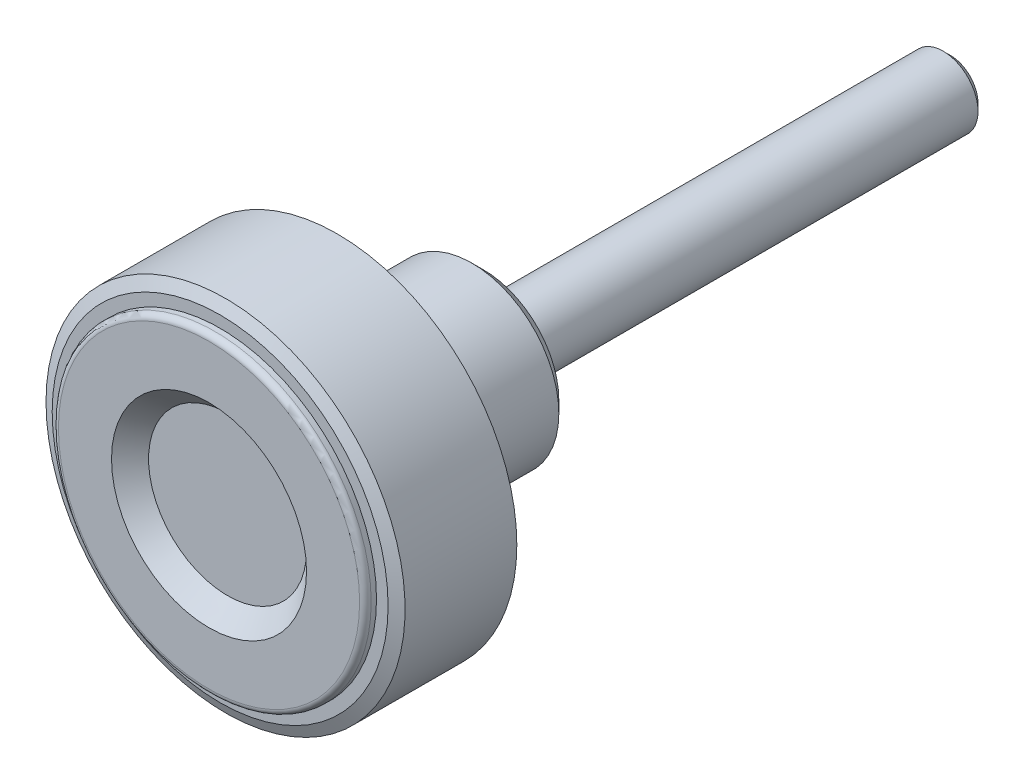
ISO-10303-21;
HEADER;
FILE_DESCRIPTION(('STEP AP214'),'2;1');
FILE_NAME('part.step','',(''),(''),'','','');
FILE_SCHEMA(('AUTOMOTIVE_DESIGN { 1 0 10303 214 1 1 1 1 }'));
ENDSEC;
DATA;
#1=APPLICATION_CONTEXT('core data for automotive mechanical design processes');
#2=APPLICATION_PROTOCOL_DEFINITION('international standard','automotive_design',2000,#1);
#3=PRODUCT_CONTEXT('',#1,'mechanical');
#4=PRODUCT('Part','Part','',(#3));
#5=PRODUCT_RELATED_PRODUCT_CATEGORY('part','',(#4));
#6=PRODUCT_DEFINITION_FORMATION('','',#4);
#7=PRODUCT_DEFINITION_CONTEXT('part definition',#1,'design');
#8=PRODUCT_DEFINITION('design','',#6,#7);
#9=PRODUCT_DEFINITION_SHAPE('','',#8);
#10=(LENGTH_UNIT() NAMED_UNIT(*) SI_UNIT(.MILLI.,.METRE.));
#11=(NAMED_UNIT(*) PLANE_ANGLE_UNIT() SI_UNIT($,.RADIAN.));
#12=(NAMED_UNIT(*) SI_UNIT($,.STERADIAN.) SOLID_ANGLE_UNIT());
#13=UNCERTAINTY_MEASURE_WITH_UNIT(LENGTH_MEASURE(1.E-05),#10,'distance_accuracy_value','');
#14=(GEOMETRIC_REPRESENTATION_CONTEXT(3) GLOBAL_UNCERTAINTY_ASSIGNED_CONTEXT((#13)) GLOBAL_UNIT_ASSIGNED_CONTEXT((#10,
#11,#12)) REPRESENTATION_CONTEXT('',''));
#15=CARTESIAN_POINT('',(0.,0.,0.));
#16=DIRECTION('',(0.,0.,1.));
#17=DIRECTION('',(1.,0.,0.));
#18=AXIS2_PLACEMENT_3D('',#15,#16,#17);
#19=CARTESIAN_POINT('',(0.,0.,0.));
#20=DIRECTION('',(0.,0.,-1.));
#21=DIRECTION('',(-1.,0.,0.));
#22=AXIS2_PLACEMENT_3D('',#19,#20,#21);
#23=CYLINDRICAL_SURFACE('',#22,15.5);
#24=CARTESIAN_POINT('',(0.,0.,22.573692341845));
#25=DIRECTION('',(0.,0.,-1.));
#26=DIRECTION('',(-1.,0.,0.));
#27=AXIS2_PLACEMENT_3D('',#24,#25,#26);
#28=CIRCLE('',#27,15.5);
#29=CARTESIAN_POINT('',(-15.5,0.,22.573692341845));
#30=VERTEX_POINT('',#29);
#31=EDGE_CURVE('E164',#30,#30,#28,.T.);
#32=ORIENTED_EDGE('',*,*,#31,.T.);
#33=EDGE_LOOP('',(#32));
#34=FACE_BOUND('',#33,.T.);
#35=CARTESIAN_POINT('',(0.,0.,12.926307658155));
#36=DIRECTION('',(0.,0.,1.));
#37=DIRECTION('',(0.,1.,0.));
#38=AXIS2_PLACEMENT_3D('',#35,#36,#37);
#39=CIRCLE('',#38,15.5);
#40=CARTESIAN_POINT('',(0.,15.5,12.926307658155));
#41=VERTEX_POINT('',#40);
#42=EDGE_CURVE('E160',#41,#41,#39,.F.);
#43=ORIENTED_EDGE('',*,*,#42,.F.);
#44=EDGE_LOOP('',(#43));
#45=FACE_BOUND('',#44,.T.);
#46=ADVANCED_FACE('F14',(#34,#45),#23,.T.);
#47=CARTESIAN_POINT('',(0.,0.,12.926307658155));
#48=DIRECTION('',(0.,0.,1.));
#49=DIRECTION('',(1.,0.,0.));
#50=AXIS2_PLACEMENT_3D('',#47,#48,#49);
#51=CONICAL_SURFACE('',#50,15.5,1.13446401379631);
#52=CARTESIAN_POINT('',(0.,0.,12.46));
#53=DIRECTION('',(0.,0.,1.));
#54=DIRECTION('',(1.,0.,0.));
#55=AXIS2_PLACEMENT_3D('',#52,#53,#54);
#56=CIRCLE('',#55,14.5);
#57=CARTESIAN_POINT('',(14.5,0.,12.46));
#58=VERTEX_POINT('',#57);
#59=EDGE_CURVE('E157',#58,#58,#56,.F.);
#60=ORIENTED_EDGE('',*,*,#59,.F.);
#61=EDGE_LOOP('',(#60));
#62=FACE_BOUND('',#61,.T.);
#63=ORIENTED_EDGE('',*,*,#42,.T.);
#64=EDGE_LOOP('',(#63));
#65=FACE_BOUND('',#64,.T.);
#66=ADVANCED_FACE('F457',(#62,#65),#51,.T.);
#67=CARTESIAN_POINT('',(0.,14.,12.46));
#68=DIRECTION('',(0.,0.,-1.));
#69=DIRECTION('',(-1.,0.,0.));
#70=AXIS2_PLACEMENT_3D('',#67,#68,#69);
#71=PLANE('',#70);
#72=ORIENTED_EDGE('',*,*,#59,.T.);
#73=EDGE_LOOP('',(#72));
#74=FACE_BOUND('',#73,.T.);
#75=CARTESIAN_POINT('',(0.,0.,12.46));
#76=DIRECTION('',(0.,0.,1.));
#77=DIRECTION('',(1.,0.,0.));
#78=AXIS2_PLACEMENT_3D('',#75,#76,#77);
#79=CIRCLE('',#78,13.5);
#80=CARTESIAN_POINT('',(13.5,0.,12.46));
#81=VERTEX_POINT('',#80);
#82=EDGE_CURVE('E154',#81,#81,#79,.F.);
#83=ORIENTED_EDGE('',*,*,#82,.F.);
#84=EDGE_LOOP('',(#83));
#85=FACE_BOUND('',#84,.T.);
#86=ADVANCED_FACE('F453',(#74,#85),#71,.T.);
#87=CARTESIAN_POINT('',(0.,1.19325,-40.));
#88=DIRECTION('',(0.,0.,-1.));
#89=DIRECTION('',(-1.,0.,0.));
#90=AXIS2_PLACEMENT_3D('',#87,#88,#89);
#91=PLANE('',#90);
#92=CARTESIAN_POINT('',(0.,0.,-39.9999999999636));
#93=DIRECTION('',(0.,0.,1.));
#94=DIRECTION('',(1.,0.,0.));
#95=AXIS2_PLACEMENT_3D('',#92,#93,#94);
#96=CIRCLE('',#95,2.38650000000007);
#97=CARTESIAN_POINT('',(2.38650000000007,0.,-39.9999999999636));
#98=VERTEX_POINT('',#97);
#99=EDGE_CURVE('E150',#98,#98,#96,.T.);
#100=ORIENTED_EDGE('',*,*,#99,.F.);
#101=EDGE_LOOP('',(#100));
#102=FACE_BOUND('',#101,.T.);
#103=ADVANCED_FACE('F449',(#102),#91,.T.);
#104=CARTESIAN_POINT('',(0.,0.,12.23));
#105=DIRECTION('',(0.,0.,1.));
#106=DIRECTION('',(1.,0.,0.));
#107=AXIS2_PLACEMENT_3D('',#104,#105,#106);
#108=CYLINDRICAL_SURFACE('',#107,13.5);
#109=ORIENTED_EDGE('',*,*,#82,.T.);
#110=EDGE_LOOP('',(#109));
#111=FACE_BOUND('',#110,.T.);
#112=CARTESIAN_POINT('',(0.,0.,12.));
#113=DIRECTION('',(0.,0.,-1.));
#114=DIRECTION('',(-1.,0.,0.));
#115=AXIS2_PLACEMENT_3D('',#112,#113,#114);
#116=CIRCLE('',#115,13.5);
#117=CARTESIAN_POINT('',(-13.5,0.,12.));
#118=VERTEX_POINT('',#117);
#119=EDGE_CURVE('E153',#118,#118,#116,.T.);
#120=ORIENTED_EDGE('',*,*,#119,.F.);
#121=EDGE_LOOP('',(#120));
#122=FACE_BOUND('',#121,.T.);
#123=ADVANCED_FACE('F416',(#111,#122),#108,.T.);
#124=CARTESIAN_POINT('',(0.,0.,-39.3865000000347));
#125=DIRECTION('',(0.,0.,1.));
#126=DIRECTION('',(1.,0.,0.));
#127=AXIS2_PLACEMENT_3D('',#124,#125,#126);
#128=CONICAL_SURFACE('',#127,2.99999999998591,0.785398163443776);
#129=ORIENTED_EDGE('',*,*,#99,.T.);
#130=EDGE_LOOP('',(#129));
#131=FACE_BOUND('',#130,.T.);
#132=CARTESIAN_POINT('',(0.,0.,-39.3865));
#133=DIRECTION('',(0.,0.,1.));
#134=DIRECTION('',(1.,0.,0.));
#135=AXIS2_PLACEMENT_3D('',#132,#133,#134);
#136=CIRCLE('',#135,3.);
#137=CARTESIAN_POINT('',(3.,0.,-39.3865));
#138=VERTEX_POINT('',#137);
#139=EDGE_CURVE('E343',#138,#138,#136,.T.);
#140=ORIENTED_EDGE('',*,*,#139,.F.);
#141=EDGE_LOOP('',(#140));
#142=FACE_BOUND('',#141,.T.);
#143=ADVANCED_FACE('F410',(#131,#142),#128,.T.);
#144=CARTESIAN_POINT('',(0.,0.,12.));
#145=DIRECTION('',(0.,0.,-1.));
#146=DIRECTION('',(-1.,0.,0.));
#147=AXIS2_PLACEMENT_3D('',#144,#145,#146);
#148=TOROIDAL_SURFACE('',#147,13.,0.5);
#149=ORIENTED_EDGE('',*,*,#119,.T.);
#150=EDGE_LOOP('',(#149));
#151=FACE_BOUND('',#150,.T.);
#152=CARTESIAN_POINT('',(0.,0.,11.5));
#153=DIRECTION('',(0.,0.,1.));
#154=DIRECTION('',(1.,0.,0.));
#155=AXIS2_PLACEMENT_3D('',#152,#153,#154);
#156=CIRCLE('',#155,13.);
#157=CARTESIAN_POINT('',(0.,13.,11.5));
#158=VERTEX_POINT('',#157);
#159=CARTESIAN_POINT('',(13.,0.,11.5));
#160=VERTEX_POINT('',#159);
#161=EDGE_CURVE('E306',#158,#160,#156,.F.);
#162=ORIENTED_EDGE('',*,*,#161,.F.);
#163=CARTESIAN_POINT('',(0.,0.,11.5));
#164=DIRECTION('',(0.,0.,1.));
#165=DIRECTION('',(0.,1.,0.));
#166=AXIS2_PLACEMENT_3D('',#163,#164,#165);
#167=CIRCLE('',#166,13.);
#168=CARTESIAN_POINT('',(-13.,0.,11.5));
#169=VERTEX_POINT('',#168);
#170=EDGE_CURVE('E149',#169,#158,#167,.F.);
#171=ORIENTED_EDGE('',*,*,#170,.F.);
#172=CARTESIAN_POINT('',(0.,0.,11.5));
#173=DIRECTION('',(0.,0.,1.));
#174=DIRECTION('',(-1.,0.,0.));
#175=AXIS2_PLACEMENT_3D('',#172,#173,#174);
#176=CIRCLE('',#175,13.);
#177=EDGE_CURVE('E340',#160,#169,#176,.F.);
#178=ORIENTED_EDGE('',*,*,#177,.F.);
#179=EDGE_LOOP('',(#162,#171,#178));
#180=FACE_BOUND('',#179,.T.);
#181=ADVANCED_FACE('F405',(#151,#180),#148,.T.);
#182=CARTESIAN_POINT('',(0.,0.,-19.19325));
#183=DIRECTION('',(0.,0.,1.));
#184=DIRECTION('',(1.,0.,0.));
#185=AXIS2_PLACEMENT_3D('',#182,#183,#184);
#186=CYLINDRICAL_SURFACE('',#185,3.);
#187=ORIENTED_EDGE('',*,*,#139,.T.);
#188=EDGE_LOOP('',(#187));
#189=FACE_BOUND('',#188,.T.);
#190=CARTESIAN_POINT('',(0.,0.,0.));
#191=DIRECTION('',(0.,0.,1.));
#192=DIRECTION('',(1.,0.,0.));
#193=AXIS2_PLACEMENT_3D('',#190,#191,#192);
#194=CIRCLE('',#193,3.);
#195=CARTESIAN_POINT('',(3.,0.,0.));
#196=VERTEX_POINT('',#195);
#197=EDGE_CURVE('E146',#196,#196,#194,.T.);
#198=ORIENTED_EDGE('',*,*,#197,.F.);
#199=EDGE_LOOP('',(#198));
#200=FACE_BOUND('',#199,.T.);
#201=ADVANCED_FACE('F323',(#189,#200),#186,.T.);
#202=CARTESIAN_POINT('',(0.,12.4615384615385,11.5));
#203=DIRECTION('',(0.,0.,-1.));
#204=DIRECTION('',(-1.,0.,0.));
#205=AXIS2_PLACEMENT_3D('',#202,#203,#204);
#206=PLANE('',#205);
#207=ORIENTED_EDGE('',*,*,#177,.T.);
#208=ORIENTED_EDGE('',*,*,#170,.T.);
#209=ORIENTED_EDGE('',*,*,#161,.T.);
#210=EDGE_LOOP('',(#207,#208,#209));
#211=FACE_BOUND('',#210,.T.);
#212=CARTESIAN_POINT('',(0.,0.,11.5));
#213=DIRECTION('',(0.,0.,1.));
#214=DIRECTION('',(1.,0.,0.));
#215=AXIS2_PLACEMENT_3D('',#212,#213,#214);
#216=CIRCLE('',#215,11.9230769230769);
#217=CARTESIAN_POINT('',(11.9230769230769,0.,11.5));
#218=VERTEX_POINT('',#217);
#219=EDGE_CURVE('E143',#218,#218,#216,.T.);
#220=ORIENTED_EDGE('',*,*,#219,.T.);
#221=EDGE_LOOP('',(#220));
#222=FACE_BOUND('',#221,.T.);
#223=ADVANCED_FACE('F312',(#211,#222),#206,.T.);
#224=CARTESIAN_POINT('',(0.,2.,0.));
#225=DIRECTION('',(0.,0.,-1.));
#226=DIRECTION('',(-1.,0.,0.));
#227=AXIS2_PLACEMENT_3D('',#224,#225,#226);
#228=PLANE('',#227);
#229=CARTESIAN_POINT('',(0.,0.,0.));
#230=DIRECTION('',(0.,0.,1.));
#231=DIRECTION('',(1.,0.,0.));
#232=AXIS2_PLACEMENT_3D('',#229,#230,#231);
#233=CIRCLE('',#232,4.);
#234=CARTESIAN_POINT('',(4.,0.,0.));
#235=VERTEX_POINT('',#234);
#236=EDGE_CURVE('E140',#235,#235,#233,.T.);
#237=ORIENTED_EDGE('',*,*,#236,.F.);
#238=EDGE_LOOP('',(#237));
#239=FACE_BOUND('',#238,.T.);
#240=ORIENTED_EDGE('',*,*,#197,.T.);
#241=EDGE_LOOP('',(#240));
#242=FACE_BOUND('',#241,.T.);
#243=ADVANCED_FACE('F322',(#239,#242),#228,.T.);
#244=CARTESIAN_POINT('',(0.,0.,15.25));
#245=DIRECTION('',(0.,0.,1.));
#246=DIRECTION('',(1.,0.,0.));
#247=AXIS2_PLACEMENT_3D('',#244,#245,#246);
#248=CYLINDRICAL_SURFACE('',#247,11.9230769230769);
#249=CARTESIAN_POINT('',(0.,0.,19.));
#250=DIRECTION('',(0.,0.,-1.));
#251=DIRECTION('',(-1.,0.,0.));
#252=AXIS2_PLACEMENT_3D('',#249,#250,#251);
#253=CIRCLE('',#252,11.9230769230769);
#254=CARTESIAN_POINT('',(-11.9230769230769,0.,19.));
#255=VERTEX_POINT('',#254);
#256=EDGE_CURVE('E139',#255,#255,#253,.F.);
#257=ORIENTED_EDGE('',*,*,#256,.T.);
#258=EDGE_LOOP('',(#257));
#259=FACE_BOUND('',#258,.T.);
#260=ORIENTED_EDGE('',*,*,#219,.F.);
#261=EDGE_LOOP('',(#260));
#262=FACE_BOUND('',#261,.T.);
#263=ADVANCED_FACE('F391',(#259,#262),#248,.F.);
#264=CARTESIAN_POINT('',(0.,0.,0.15));
#265=DIRECTION('',(0.,0.,1.));
#266=DIRECTION('',(1.,0.,0.));
#267=AXIS2_PLACEMENT_3D('',#264,#265,#266);
#268=CYLINDRICAL_SURFACE('',#267,4.);
#269=ORIENTED_EDGE('',*,*,#236,.T.);
#270=EDGE_LOOP('',(#269));
#271=FACE_BOUND('',#270,.T.);
#272=CARTESIAN_POINT('',(0.,0.,0.3));
#273=DIRECTION('',(0.,0.,1.));
#274=DIRECTION('',(1.,0.,0.));
#275=AXIS2_PLACEMENT_3D('',#272,#273,#274);
#276=CIRCLE('',#275,4.);
#277=CARTESIAN_POINT('',(4.,0.,0.3));
#278=VERTEX_POINT('',#277);
#279=EDGE_CURVE('E135',#278,#278,#276,.T.);
#280=ORIENTED_EDGE('',*,*,#279,.F.);
#281=EDGE_LOOP('',(#280));
#282=FACE_BOUND('',#281,.T.);
#283=ADVANCED_FACE('F282',(#271,#282),#268,.T.);
#284=CARTESIAN_POINT('',(0.,0.,19.));
#285=DIRECTION('',(0.,0.,-1.));
#286=DIRECTION('',(-1.,0.,0.));
#287=AXIS2_PLACEMENT_3D('',#284,#285,#286);
#288=TOROIDAL_SURFACE('',#287,10.9230769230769,1.);
#289=CARTESIAN_POINT('',(0.,0.,20.));
#290=DIRECTION('',(0.,0.,1.));
#291=DIRECTION('',(0.,1.,0.));
#292=AXIS2_PLACEMENT_3D('',#289,#290,#291);
#293=CIRCLE('',#292,10.9230769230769);
#294=CARTESIAN_POINT('',(-10.9230769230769,0.,20.));
#295=VERTEX_POINT('',#294);
#296=CARTESIAN_POINT('',(0.,10.9230769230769,20.));
#297=VERTEX_POINT('',#296);
#298=EDGE_CURVE('E134',#295,#297,#293,.F.);
#299=ORIENTED_EDGE('',*,*,#298,.F.);
#300=CARTESIAN_POINT('',(0.,0.,20.));
#301=DIRECTION('',(0.,0.,1.));
#302=DIRECTION('',(-1.,0.,0.));
#303=AXIS2_PLACEMENT_3D('',#300,#301,#302);
#304=CIRCLE('',#303,10.9230769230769);
#305=CARTESIAN_POINT('',(10.9230769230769,0.,20.));
#306=VERTEX_POINT('',#305);
#307=EDGE_CURVE('E656',#306,#295,#304,.F.);
#308=ORIENTED_EDGE('',*,*,#307,.F.);
#309=CARTESIAN_POINT('',(0.,0.,20.));
#310=DIRECTION('',(0.,0.,1.));
#311=DIRECTION('',(1.,0.,0.));
#312=AXIS2_PLACEMENT_3D('',#309,#310,#311);
#313=CIRCLE('',#312,10.9230769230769);
#314=EDGE_CURVE('E138',#297,#306,#313,.F.);
#315=ORIENTED_EDGE('',*,*,#314,.F.);
#316=EDGE_LOOP('',(#299,#308,#315));
#317=FACE_BOUND('',#316,.T.);
#318=ORIENTED_EDGE('',*,*,#256,.F.);
#319=EDGE_LOOP('',(#318));
#320=FACE_BOUND('',#319,.T.);
#321=ADVANCED_FACE('F278',(#317,#320),#288,.F.);
#322=CARTESIAN_POINT('',(0.,5.25,0.3));
#323=DIRECTION('',(0.,0.,-1.));
#324=DIRECTION('',(-1.,0.,0.));
#325=AXIS2_PLACEMENT_3D('',#322,#323,#324);
#326=PLANE('',#325);
#327=CARTESIAN_POINT('',(0.,0.,0.3));
#328=DIRECTION('',(0.,0.,1.));
#329=DIRECTION('',(1.,0.,0.));
#330=AXIS2_PLACEMENT_3D('',#327,#328,#329);
#331=CIRCLE('',#330,6.5);
#332=CARTESIAN_POINT('',(6.5,0.,0.3));
#333=VERTEX_POINT('',#332);
#334=EDGE_CURVE('E125',#333,#333,#331,.T.);
#335=ORIENTED_EDGE('',*,*,#334,.F.);
#336=EDGE_LOOP('',(#335));
#337=FACE_BOUND('',#336,.T.);
#338=ORIENTED_EDGE('',*,*,#279,.T.);
#339=EDGE_LOOP('',(#338));
#340=FACE_BOUND('',#339,.T.);
#341=ADVANCED_FACE('F216',(#337,#340),#326,.T.);
#342=CARTESIAN_POINT('',(0.,9.71153846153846,20.));
#343=DIRECTION('',(0.,0.,-1.));
#344=DIRECTION('',(-1.,0.,0.));
#345=AXIS2_PLACEMENT_3D('',#342,#343,#344);
#346=PLANE('',#345);
#347=ORIENTED_EDGE('',*,*,#307,.T.);
#348=ORIENTED_EDGE('',*,*,#298,.T.);
#349=ORIENTED_EDGE('',*,*,#314,.T.);
#350=EDGE_LOOP('',(#347,#348,#349));
#351=FACE_BOUND('',#350,.T.);
#352=CARTESIAN_POINT('',(0.,0.,20.));
#353=DIRECTION('',(0.,0.,-1.));
#354=DIRECTION('',(-1.,0.,0.));
#355=AXIS2_PLACEMENT_3D('',#352,#353,#354);
#356=CIRCLE('',#355,8.5);
#357=CARTESIAN_POINT('',(0.,8.5,20.));
#358=VERTEX_POINT('',#357);
#359=CARTESIAN_POINT('',(-8.5,0.,20.));
#360=VERTEX_POINT('',#359);
#361=EDGE_CURVE('E33',#358,#360,#356,.F.);
#362=ORIENTED_EDGE('',*,*,#361,.T.);
#363=CARTESIAN_POINT('',(0.,0.,20.));
#364=DIRECTION('',(0.,0.,-1.));
#365=DIRECTION('',(1.,0.,0.));
#366=AXIS2_PLACEMENT_3D('',#363,#364,#365);
#367=CIRCLE('',#366,8.5);
#368=CARTESIAN_POINT('',(8.5,0.,20.));
#369=VERTEX_POINT('',#368);
#370=EDGE_CURVE('E133',#360,#369,#367,.F.);
#371=ORIENTED_EDGE('',*,*,#370,.T.);
#372=CARTESIAN_POINT('',(0.,0.,20.));
#373=DIRECTION('',(0.,0.,-1.));
#374=DIRECTION('',(0.,1.,0.));
#375=AXIS2_PLACEMENT_3D('',#372,#373,#374);
#376=CIRCLE('',#375,8.5);
#377=EDGE_CURVE('E203',#369,#358,#376,.F.);
#378=ORIENTED_EDGE('',*,*,#377,.T.);
#379=EDGE_LOOP('',(#362,#371,#378));
#380=FACE_BOUND('',#379,.T.);
#381=ADVANCED_FACE('F207',(#351,#380),#346,.T.);
#382=CARTESIAN_POINT('',(0.,0.,1.3));
#383=DIRECTION('',(0.,0.,1.));
#384=DIRECTION('',(1.,0.,0.));
#385=AXIS2_PLACEMENT_3D('',#382,#383,#384);
#386=CONICAL_SURFACE('',#385,7.5,0.785398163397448);
#387=ORIENTED_EDGE('',*,*,#334,.T.);
#388=EDGE_LOOP('',(#387));
#389=FACE_BOUND('',#388,.T.);
#390=CARTESIAN_POINT('',(0.,0.,1.3));
#391=DIRECTION('',(0.,0.,1.));
#392=DIRECTION('',(1.,0.,0.));
#393=AXIS2_PLACEMENT_3D('',#390,#391,#392);
#394=CIRCLE('',#393,7.5);
#395=CARTESIAN_POINT('',(7.5,0.,1.3));
#396=VERTEX_POINT('',#395);
#397=EDGE_CURVE('E24',#396,#396,#394,.T.);
#398=ORIENTED_EDGE('',*,*,#397,.F.);
#399=EDGE_LOOP('',(#398));
#400=FACE_BOUND('',#399,.T.);
#401=ADVANCED_FACE('F194',(#389,#400),#386,.T.);
#402=CARTESIAN_POINT('',(0.,0.,19.));
#403=DIRECTION('',(0.,0.,-1.));
#404=DIRECTION('',(-1.,0.,0.));
#405=AXIS2_PLACEMENT_3D('',#402,#403,#404);
#406=TOROIDAL_SURFACE('',#405,8.5,1.);
#407=CARTESIAN_POINT('',(0.,0.,19.));
#408=DIRECTION('',(0.,0.,1.));
#409=DIRECTION('',(1.,0.,0.));
#410=AXIS2_PLACEMENT_3D('',#407,#408,#409);
#411=CIRCLE('',#410,7.5);
#412=CARTESIAN_POINT('',(7.5,0.,19.));
#413=VERTEX_POINT('',#412);
#414=EDGE_CURVE('E9',#413,#413,#411,.F.);
#415=ORIENTED_EDGE('',*,*,#414,.F.);
#416=EDGE_LOOP('',(#415));
#417=FACE_BOUND('',#416,.T.);
#418=ORIENTED_EDGE('',*,*,#370,.F.);
#419=ORIENTED_EDGE('',*,*,#361,.F.);
#420=ORIENTED_EDGE('',*,*,#377,.F.);
#421=EDGE_LOOP('',(#418,#419,#420));
#422=FACE_BOUND('',#421,.T.);
#423=ADVANCED_FACE('F182',(#417,#422),#406,.F.);
#424=CARTESIAN_POINT('',(0.,0.,10.15));
#425=DIRECTION('',(0.,0.,1.));
#426=DIRECTION('',(1.,0.,0.));
#427=AXIS2_PLACEMENT_3D('',#424,#425,#426);
#428=CYLINDRICAL_SURFACE('',#427,7.5);
#429=ORIENTED_EDGE('',*,*,#397,.T.);
#430=EDGE_LOOP('',(#429));
#431=FACE_BOUND('',#430,.T.);
#432=ORIENTED_EDGE('',*,*,#414,.T.);
#433=EDGE_LOOP('',(#432));
#434=FACE_BOUND('',#433,.T.);
#435=ADVANCED_FACE('F193',(#431,#434),#428,.T.);
#436=CARTESIAN_POINT('',(0.,3.40909090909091,22.4));
#437=DIRECTION('',(0.,0.,1.));
#438=DIRECTION('',(1.,0.,0.));
#439=AXIS2_PLACEMENT_3D('',#436,#437,#438);
#440=PLANE('',#439);
#441=CARTESIAN_POINT('',(0.,0.,22.4));
#442=DIRECTION('',(0.,0.,1.));
#443=DIRECTION('',(1.,0.,0.));
#444=AXIS2_PLACEMENT_3D('',#441,#442,#443);
#445=CIRCLE('',#444,6.81818181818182);
#446=CARTESIAN_POINT('',(6.81818181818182,0.,22.4));
#447=VERTEX_POINT('',#446);
#448=EDGE_CURVE('E171',#447,#447,#445,.T.);
#449=ORIENTED_EDGE('',*,*,#448,.T.);
#450=EDGE_LOOP('',(#449));
#451=FACE_BOUND('',#450,.T.);
#452=ADVANCED_FACE('F16',(#451),#440,.T.);
#453=CARTESIAN_POINT('',(0.,0.,24.));
#454=DIRECTION('',(0.,0.,1.));
#455=DIRECTION('',(1.,0.,0.));
#456=AXIS2_PLACEMENT_3D('',#453,#454,#455);
#457=CONICAL_SURFACE('',#456,8.41818181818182,0.785398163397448);
#458=CARTESIAN_POINT('',(0.,0.,24.));
#459=DIRECTION('',(0.,0.,1.));
#460=DIRECTION('',(1.,0.,0.));
#461=AXIS2_PLACEMENT_3D('',#458,#459,#460);
#462=CIRCLE('',#461,8.41818181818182);
#463=CARTESIAN_POINT('',(8.41818181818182,0.,24.));
#464=VERTEX_POINT('',#463);
#465=EDGE_CURVE('E77',#464,#464,#462,.F.);
#466=ORIENTED_EDGE('',*,*,#465,.F.);
#467=EDGE_LOOP('',(#466));
#468=FACE_BOUND('',#467,.T.);
#469=ORIENTED_EDGE('',*,*,#448,.F.);
#470=EDGE_LOOP('',(#469));
#471=FACE_BOUND('',#470,.T.);
#472=ADVANCED_FACE('F99',(#468,#471),#457,.F.);
#473=CARTESIAN_POINT('',(0.,10.7090909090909,24.));
#474=DIRECTION('',(0.,0.,1.));
#475=DIRECTION('',(1.,0.,0.));
#476=AXIS2_PLACEMENT_3D('',#473,#474,#475);
#477=PLANE('',#476);
#478=ORIENTED_EDGE('',*,*,#465,.T.);
#479=EDGE_LOOP('',(#478));
#480=FACE_BOUND('',#479,.T.);
#481=CARTESIAN_POINT('',(0.,0.,24.));
#482=DIRECTION('',(0.,0.,-1.));
#483=DIRECTION('',(-1.,0.,0.));
#484=AXIS2_PLACEMENT_3D('',#481,#482,#483);
#485=CIRCLE('',#484,13.);
#486=CARTESIAN_POINT('',(-13.,0.,24.));
#487=VERTEX_POINT('',#486);
#488=CARTESIAN_POINT('',(0.,13.,24.));
#489=VERTEX_POINT('',#488);
#490=EDGE_CURVE('E71',#487,#489,#485,.T.);
#491=ORIENTED_EDGE('',*,*,#490,.F.);
#492=CARTESIAN_POINT('',(0.,0.,24.));
#493=DIRECTION('',(0.,0.,-1.));
#494=DIRECTION('',(1.,0.,0.));
#495=AXIS2_PLACEMENT_3D('',#492,#493,#494);
#496=CIRCLE('',#495,13.);
#497=CARTESIAN_POINT('',(13.,0.,24.));
#498=VERTEX_POINT('',#497);
#499=EDGE_CURVE('E66',#498,#487,#496,.T.);
#500=ORIENTED_EDGE('',*,*,#499,.F.);
#501=CARTESIAN_POINT('',(0.,0.,24.));
#502=DIRECTION('',(0.,0.,-1.));
#503=DIRECTION('',(0.,1.,0.));
#504=AXIS2_PLACEMENT_3D('',#501,#502,#503);
#505=CIRCLE('',#504,13.);
#506=EDGE_CURVE('E73',#489,#498,#505,.T.);
#507=ORIENTED_EDGE('',*,*,#506,.F.);
#508=EDGE_LOOP('',(#491,#500,#507));
#509=FACE_BOUND('',#508,.T.);
#510=ADVANCED_FACE('F81',(#480,#509),#477,.T.);
#511=CARTESIAN_POINT('',(0.,0.,23.5));
#512=DIRECTION('',(0.,0.,-1.));
#513=DIRECTION('',(-1.,0.,0.));
#514=AXIS2_PLACEMENT_3D('',#511,#512,#513);
#515=TOROIDAL_SURFACE('',#514,13.,0.5);
#516=ORIENTED_EDGE('',*,*,#499,.T.);
#517=ORIENTED_EDGE('',*,*,#490,.T.);
#518=ORIENTED_EDGE('',*,*,#506,.T.);
#519=EDGE_LOOP('',(#516,#517,#518));
#520=FACE_BOUND('',#519,.T.);
#521=CARTESIAN_POINT('',(0.,0.,23.5));
#522=DIRECTION('',(0.,0.,1.));
#523=DIRECTION('',(1.,0.,0.));
#524=AXIS2_PLACEMENT_3D('',#521,#522,#523);
#525=CIRCLE('',#524,13.5);
#526=CARTESIAN_POINT('',(13.5,0.,23.5));
#527=VERTEX_POINT('',#526);
#528=EDGE_CURVE('E168',#527,#527,#525,.F.);
#529=ORIENTED_EDGE('',*,*,#528,.F.);
#530=EDGE_LOOP('',(#529));
#531=FACE_BOUND('',#530,.T.);
#532=ADVANCED_FACE('F69',(#520,#531),#515,.T.);
#533=CARTESIAN_POINT('',(0.,0.,23.27));
#534=DIRECTION('',(0.,0.,1.));
#535=DIRECTION('',(1.,0.,0.));
#536=AXIS2_PLACEMENT_3D('',#533,#534,#535);
#537=CYLINDRICAL_SURFACE('',#536,13.5);
#538=CARTESIAN_POINT('',(0.,0.,23.04));
#539=DIRECTION('',(0.,0.,1.));
#540=DIRECTION('',(1.,0.,0.));
#541=AXIS2_PLACEMENT_3D('',#538,#539,#540);
#542=CIRCLE('',#541,13.5);
#543=CARTESIAN_POINT('',(13.5,0.,23.04));
#544=VERTEX_POINT('',#543);
#545=EDGE_CURVE('E165',#544,#544,#542,.F.);
#546=ORIENTED_EDGE('',*,*,#545,.F.);
#547=EDGE_LOOP('',(#546));
#548=FACE_BOUND('',#547,.T.);
#549=ORIENTED_EDGE('',*,*,#528,.T.);
#550=EDGE_LOOP('',(#549));
#551=FACE_BOUND('',#550,.T.);
#552=ADVANCED_FACE('F359',(#548,#551),#537,.T.);
#553=CARTESIAN_POINT('',(0.,0.,22.573692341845));
#554=DIRECTION('',(0.,0.,-1.));
#555=DIRECTION('',(-1.,0.,0.));
#556=AXIS2_PLACEMENT_3D('',#553,#554,#555);
#557=CONICAL_SURFACE('',#556,15.5,1.13446401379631);
#558=ORIENTED_EDGE('',*,*,#31,.F.);
#559=EDGE_LOOP('',(#558));
#560=FACE_BOUND('',#559,.T.);
#561=CARTESIAN_POINT('',(0.,0.,23.04));
#562=DIRECTION('',(0.,0.,-1.));
#563=DIRECTION('',(-1.,0.,0.));
#564=AXIS2_PLACEMENT_3D('',#561,#562,#563);
#565=CIRCLE('',#564,14.5);
#566=CARTESIAN_POINT('',(-14.5,0.,23.04));
#567=VERTEX_POINT('',#566);
#568=EDGE_CURVE('E161',#567,#567,#565,.T.);
#569=ORIENTED_EDGE('',*,*,#568,.T.);
#570=EDGE_LOOP('',(#569));
#571=FACE_BOUND('',#570,.T.);
#572=ADVANCED_FACE('F366',(#560,#571),#557,.T.);
#573=CARTESIAN_POINT('',(0.,14.,23.04));
#574=DIRECTION('',(0.,0.,1.));
#575=DIRECTION('',(1.,0.,0.));
#576=AXIS2_PLACEMENT_3D('',#573,#574,#575);
#577=PLANE('',#576);
#578=ORIENTED_EDGE('',*,*,#545,.T.);
#579=EDGE_LOOP('',(#578));
#580=FACE_BOUND('',#579,.T.);
#581=ORIENTED_EDGE('',*,*,#568,.F.);
#582=EDGE_LOOP('',(#581));
#583=FACE_BOUND('',#582,.T.);
#584=ADVANCED_FACE('F467',(#580,#583),#577,.T.);
#585=CLOSED_SHELL('',(#46,#66,#86,#103,#123,#143,#181,#201,#223,#243,#263,#283,#321,#341,#381,
#401,#423,#435,#452,#472,#510,#532,#552,#572,#584));
#586=MANIFOLD_SOLID_BREP('B1',#585);
#587=ADVANCED_BREP_SHAPE_REPRESENTATION('',(#18,#586),#14);
#588=SHAPE_DEFINITION_REPRESENTATION(#9,#587);
ENDSEC;
END-ISO-10303-21;
